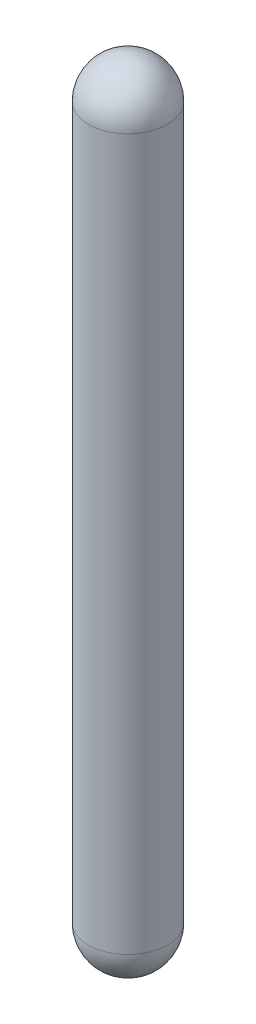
ISO-10303-21;
HEADER;
FILE_DESCRIPTION(('STEP AP214'),'2;1');
FILE_NAME('part.step','',(''),(''),'','','');
FILE_SCHEMA(('AUTOMOTIVE_DESIGN { 1 0 10303 214 1 1 1 1 }'));
ENDSEC;
DATA;
#1=APPLICATION_CONTEXT('core data for automotive mechanical design processes');
#2=APPLICATION_PROTOCOL_DEFINITION('international standard','automotive_design',2000,#1);
#3=PRODUCT_CONTEXT('',#1,'mechanical');
#4=PRODUCT('Part','Part','',(#3));
#5=PRODUCT_RELATED_PRODUCT_CATEGORY('part','',(#4));
#6=PRODUCT_DEFINITION_FORMATION('','',#4);
#7=PRODUCT_DEFINITION_CONTEXT('part definition',#1,'design');
#8=PRODUCT_DEFINITION('design','',#6,#7);
#9=PRODUCT_DEFINITION_SHAPE('','',#8);
#10=(LENGTH_UNIT() NAMED_UNIT(*) SI_UNIT(.MILLI.,.METRE.));
#11=(NAMED_UNIT(*) PLANE_ANGLE_UNIT() SI_UNIT($,.RADIAN.));
#12=(NAMED_UNIT(*) SI_UNIT($,.STERADIAN.) SOLID_ANGLE_UNIT());
#13=UNCERTAINTY_MEASURE_WITH_UNIT(LENGTH_MEASURE(1.E-05),#10,'distance_accuracy_value','');
#14=(GEOMETRIC_REPRESENTATION_CONTEXT(3) GLOBAL_UNCERTAINTY_ASSIGNED_CONTEXT((#13)) GLOBAL_UNIT_ASSIGNED_CONTEXT((#10,
#11,#12)) REPRESENTATION_CONTEXT('',''));
#15=CARTESIAN_POINT('',(0.,0.,0.));
#16=DIRECTION('',(0.,0.,1.));
#17=DIRECTION('',(1.,0.,0.));
#18=AXIS2_PLACEMENT_3D('',#15,#16,#17);
#19=CARTESIAN_POINT('',(0.,45.,0.));
#20=DIRECTION('',(0.,-1.,0.));
#21=DIRECTION('',(0.,0.,-1.));
#22=AXIS2_PLACEMENT_3D('',#19,#20,#21);
#23=CYLINDRICAL_SURFACE('',#22,2.5);
#24=CARTESIAN_POINT('',(0.,0.,0.));
#25=DIRECTION('',(0.,1.,0.));
#26=DIRECTION('',(-1.,0.,0.));
#27=AXIS2_PLACEMENT_3D('',#24,#25,#26);
#28=CIRCLE('',#27,2.5);
#29=CARTESIAN_POINT('',(0.,0.,-2.5));
#30=VERTEX_POINT('',#29);
#31=CARTESIAN_POINT('',(0.,0.,2.5));
#32=VERTEX_POINT('',#31);
#33=EDGE_CURVE('E11',#30,#32,#28,.T.);
#34=ORIENTED_EDGE('',*,*,#33,.T.);
#35=CARTESIAN_POINT('',(0.,0.,0.));
#36=DIRECTION('',(0.,-1.,0.));
#37=DIRECTION('',(1.,0.,0.));
#38=AXIS2_PLACEMENT_3D('',#35,#36,#37);
#39=CIRCLE('',#38,2.5);
#40=EDGE_CURVE('E24',#30,#32,#39,.T.);
#41=ORIENTED_EDGE('',*,*,#40,.F.);
#42=EDGE_LOOP('',(#34,#41));
#43=FACE_BOUND('',#42,.T.);
#44=CARTESIAN_POINT('',(0.,45.,0.));
#45=DIRECTION('',(0.,1.,0.));
#46=DIRECTION('',(-1.,0.,0.));
#47=AXIS2_PLACEMENT_3D('',#44,#45,#46);
#48=CIRCLE('',#47,2.5);
#49=CARTESIAN_POINT('',(0.,45.,-2.5));
#50=VERTEX_POINT('',#49);
#51=CARTESIAN_POINT('',(0.,45.,2.5));
#52=VERTEX_POINT('',#51);
#53=EDGE_CURVE('E30',#50,#52,#48,.T.);
#54=ORIENTED_EDGE('',*,*,#53,.F.);
#55=CARTESIAN_POINT('',(0.,45.,0.));
#56=DIRECTION('',(0.,-1.,0.));
#57=DIRECTION('',(1.,0.,0.));
#58=AXIS2_PLACEMENT_3D('',#55,#56,#57);
#59=CIRCLE('',#58,2.5);
#60=EDGE_CURVE('E40',#50,#52,#59,.T.);
#61=ORIENTED_EDGE('',*,*,#60,.T.);
#62=EDGE_LOOP('',(#54,#61));
#63=FACE_BOUND('',#62,.T.);
#64=ADVANCED_FACE('F16',(#43,#63),#23,.T.);
#65=CARTESIAN_POINT('',(0.,0.,0.));
#66=DIRECTION('',(0.,0.,1.));
#67=DIRECTION('',(1.,0.,0.));
#68=AXIS2_PLACEMENT_3D('',#65,#66,#67);
#69=SPHERICAL_SURFACE('',#68,2.5);
#70=CARTESIAN_POINT('',(0.,0.,0.));
#71=DIRECTION('',(0.,1.,0.));
#72=DIRECTION('',(-1.,0.,0.));
#73=AXIS2_PLACEMENT_3D('',#70,#71,#72);
#74=SPHERICAL_SURFACE('',#73,2.5);
#75=ORIENTED_EDGE('',*,*,#33,.F.);
#76=ORIENTED_EDGE('',*,*,#40,.T.);
#77=EDGE_LOOP('',(#75,#76));
#78=FACE_BOUND('',#77,.T.);
#79=ADVANCED_FACE('F62',(#78),#74,.T.);
#80=CARTESIAN_POINT('',(0.,45.,0.));
#81=DIRECTION('',(0.,0.,1.));
#82=DIRECTION('',(-1.,0.,0.));
#83=AXIS2_PLACEMENT_3D('',#80,#81,#82);
#84=SPHERICAL_SURFACE('',#83,2.5);
#85=CARTESIAN_POINT('',(0.,45.,0.));
#86=DIRECTION('',(0.,-1.,0.));
#87=DIRECTION('',(1.,0.,0.));
#88=AXIS2_PLACEMENT_3D('',#85,#86,#87);
#89=SPHERICAL_SURFACE('',#88,2.5);
#90=ORIENTED_EDGE('',*,*,#60,.F.);
#91=ORIENTED_EDGE('',*,*,#53,.T.);
#92=EDGE_LOOP('',(#90,#91));
#93=FACE_BOUND('',#92,.T.);
#94=ADVANCED_FACE('F41',(#93),#89,.T.);
#95=CLOSED_SHELL('',(#64,#79,#94));
#96=MANIFOLD_SOLID_BREP('B1',#95);
#97=ADVANCED_BREP_SHAPE_REPRESENTATION('',(#18,#96),#14);
#98=SHAPE_DEFINITION_REPRESENTATION(#9,#97);
ENDSEC;
END-ISO-10303-21;
